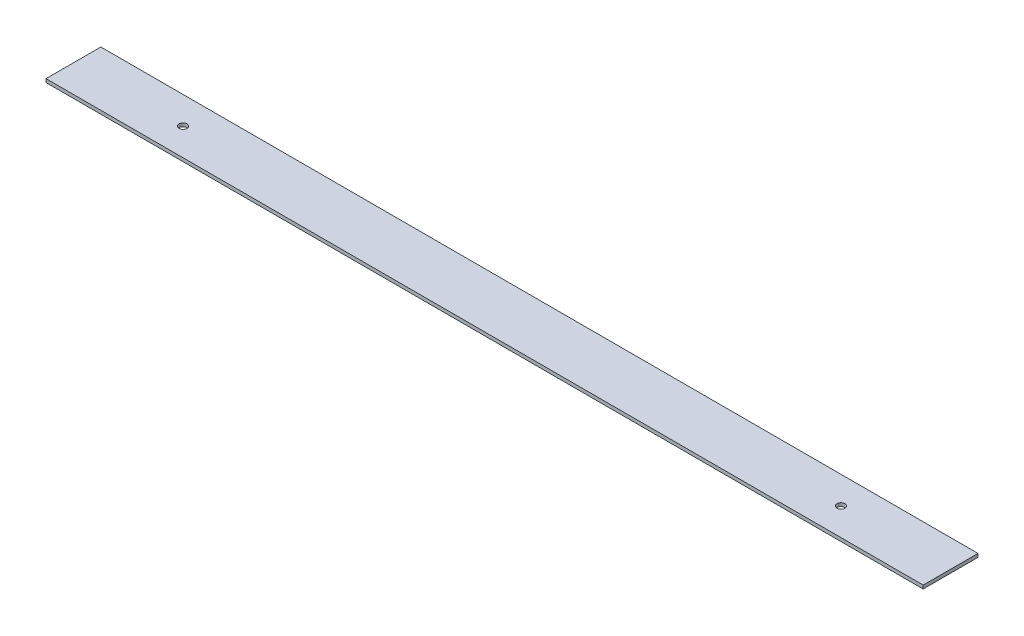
ISO-10303-21;
HEADER;
FILE_DESCRIPTION(('STEP AP214'),'2;1');
FILE_NAME('part.step','',(''),(''),'','','');
FILE_SCHEMA(('AUTOMOTIVE_DESIGN { 1 0 10303 214 1 1 1 1 }'));
ENDSEC;
DATA;
#1=APPLICATION_CONTEXT('core data for automotive mechanical design processes');
#2=APPLICATION_PROTOCOL_DEFINITION('international standard','automotive_design',2000,#1);
#3=PRODUCT_CONTEXT('',#1,'mechanical');
#4=PRODUCT('Part','Part','',(#3));
#5=PRODUCT_RELATED_PRODUCT_CATEGORY('part','',(#4));
#6=PRODUCT_DEFINITION_FORMATION('','',#4);
#7=PRODUCT_DEFINITION_CONTEXT('part definition',#1,'design');
#8=PRODUCT_DEFINITION('design','',#6,#7);
#9=PRODUCT_DEFINITION_SHAPE('','',#8);
#10=(LENGTH_UNIT() NAMED_UNIT(*) SI_UNIT(.MILLI.,.METRE.));
#11=(NAMED_UNIT(*) PLANE_ANGLE_UNIT() SI_UNIT($,.RADIAN.));
#12=(NAMED_UNIT(*) SI_UNIT($,.STERADIAN.) SOLID_ANGLE_UNIT());
#13=UNCERTAINTY_MEASURE_WITH_UNIT(LENGTH_MEASURE(1.E-05),#10,'distance_accuracy_value','');
#14=(GEOMETRIC_REPRESENTATION_CONTEXT(3) GLOBAL_UNCERTAINTY_ASSIGNED_CONTEXT((#13)) GLOBAL_UNIT_ASSIGNED_CONTEXT((#10,
#11,#12)) REPRESENTATION_CONTEXT('',''));
#15=CARTESIAN_POINT('',(0.,0.,0.));
#16=DIRECTION('',(0.,0.,1.));
#17=DIRECTION('',(1.,0.,0.));
#18=AXIS2_PLACEMENT_3D('',#15,#16,#17);
#19=CARTESIAN_POINT('',(609.6,4.7625,-38.1));
#20=DIRECTION('',(-1.,0.,0.));
#21=DIRECTION('',(0.,0.,1.));
#22=AXIS2_PLACEMENT_3D('',#19,#20,#21);
#23=PLANE('',#22);
#24=DIRECTION('',(0.,0.,-1.));
#25=VECTOR('',#24,1.);
#26=CARTESIAN_POINT('',(609.6,0.,-38.1));
#27=LINE('',#26,#25);
#28=CARTESIAN_POINT('',(609.6,0.,38.1));
#29=VERTEX_POINT('',#28);
#30=CARTESIAN_POINT('',(609.6,0.,-38.1));
#31=VERTEX_POINT('',#30);
#32=EDGE_CURVE('E96',#29,#31,#27,.T.);
#33=ORIENTED_EDGE('',*,*,#32,.T.);
#34=DIRECTION('',(0.,-1.,0.));
#35=VECTOR('',#34,1.);
#36=CARTESIAN_POINT('',(609.6,4.7625,-38.1));
#37=LINE('',#36,#35);
#38=CARTESIAN_POINT('',(609.6,4.7625,-38.1));
#39=VERTEX_POINT('',#38);
#40=EDGE_CURVE('E11',#39,#31,#37,.T.);
#41=ORIENTED_EDGE('',*,*,#40,.F.);
#42=DIRECTION('',(0.,0.,-1.));
#43=VECTOR('',#42,1.);
#44=CARTESIAN_POINT('',(609.6,4.7625,-38.1));
#45=LINE('',#44,#43);
#46=CARTESIAN_POINT('',(609.6,4.7625,38.1));
#47=VERTEX_POINT('',#46);
#48=EDGE_CURVE('E84',#47,#39,#45,.T.);
#49=ORIENTED_EDGE('',*,*,#48,.F.);
#50=DIRECTION('',(0.,-1.,0.));
#51=VECTOR('',#50,1.);
#52=CARTESIAN_POINT('',(609.6,4.7625,38.1));
#53=LINE('',#52,#51);
#54=EDGE_CURVE('E92',#47,#29,#53,.T.);
#55=ORIENTED_EDGE('',*,*,#54,.T.);
#56=EDGE_LOOP('',(#33,#41,#49,#55));
#57=FACE_BOUND('',#56,.T.);
#58=ADVANCED_FACE('F33',(#57),#23,.F.);
#59=CARTESIAN_POINT('',(-609.6,4.7625,-38.1));
#60=DIRECTION('',(0.,0.,1.));
#61=DIRECTION('',(1.,0.,0.));
#62=AXIS2_PLACEMENT_3D('',#59,#60,#61);
#63=PLANE('',#62);
#64=DIRECTION('',(-1.,0.,0.));
#65=VECTOR('',#64,1.);
#66=CARTESIAN_POINT('',(-609.6,0.,-38.1));
#67=LINE('',#66,#65);
#68=CARTESIAN_POINT('',(-609.6,0.,-38.1));
#69=VERTEX_POINT('',#68);
#70=EDGE_CURVE('E88',#31,#69,#67,.T.);
#71=ORIENTED_EDGE('',*,*,#70,.T.);
#72=DIRECTION('',(0.,-1.,0.));
#73=VECTOR('',#72,1.);
#74=CARTESIAN_POINT('',(-609.6,4.7625,-38.1));
#75=LINE('',#74,#73);
#76=CARTESIAN_POINT('',(-609.6,4.7625,-38.1));
#77=VERTEX_POINT('',#76);
#78=EDGE_CURVE('E41',#77,#69,#75,.T.);
#79=ORIENTED_EDGE('',*,*,#78,.F.);
#80=DIRECTION('',(-1.,0.,0.));
#81=VECTOR('',#80,1.);
#82=CARTESIAN_POINT('',(-609.6,4.7625,-38.1));
#83=LINE('',#82,#81);
#84=EDGE_CURVE('E79',#39,#77,#83,.T.);
#85=ORIENTED_EDGE('',*,*,#84,.F.);
#86=ORIENTED_EDGE('',*,*,#40,.T.);
#87=EDGE_LOOP('',(#71,#79,#85,#86));
#88=FACE_BOUND('',#87,.T.);
#89=ADVANCED_FACE('F87',(#88),#63,.F.);
#90=CARTESIAN_POINT('',(-609.6,4.7625,-38.1));
#91=DIRECTION('',(1.,0.,0.));
#92=DIRECTION('',(0.,0.,-1.));
#93=AXIS2_PLACEMENT_3D('',#90,#91,#92);
#94=PLANE('',#93);
#95=DIRECTION('',(0.,0.,1.));
#96=VECTOR('',#95,1.);
#97=CARTESIAN_POINT('',(-609.6,0.,-38.1));
#98=LINE('',#97,#96);
#99=CARTESIAN_POINT('',(-609.6,0.,38.1));
#100=VERTEX_POINT('',#99);
#101=EDGE_CURVE('E66',#69,#100,#98,.T.);
#102=ORIENTED_EDGE('',*,*,#101,.T.);
#103=DIRECTION('',(0.,-1.,0.));
#104=VECTOR('',#103,1.);
#105=CARTESIAN_POINT('',(-609.6,4.7625,38.1));
#106=LINE('',#105,#104);
#107=CARTESIAN_POINT('',(-609.6,4.7625,38.1));
#108=VERTEX_POINT('',#107);
#109=EDGE_CURVE('E89',#108,#100,#106,.T.);
#110=ORIENTED_EDGE('',*,*,#109,.F.);
#111=DIRECTION('',(0.,0.,1.));
#112=VECTOR('',#111,1.);
#113=CARTESIAN_POINT('',(-609.6,4.7625,-38.1));
#114=LINE('',#113,#112);
#115=EDGE_CURVE('E82',#77,#108,#114,.T.);
#116=ORIENTED_EDGE('',*,*,#115,.F.);
#117=ORIENTED_EDGE('',*,*,#78,.T.);
#118=EDGE_LOOP('',(#102,#110,#116,#117));
#119=FACE_BOUND('',#118,.T.);
#120=ADVANCED_FACE('F90',(#119),#94,.F.);
#121=CARTESIAN_POINT('',(-609.6,4.7625,38.1));
#122=DIRECTION('',(0.,0.,-1.));
#123=DIRECTION('',(-1.,0.,0.));
#124=AXIS2_PLACEMENT_3D('',#121,#122,#123);
#125=PLANE('',#124);
#126=DIRECTION('',(1.,0.,0.));
#127=VECTOR('',#126,1.);
#128=CARTESIAN_POINT('',(-609.6,0.,38.1));
#129=LINE('',#128,#127);
#130=EDGE_CURVE('E72',#100,#29,#129,.T.);
#131=ORIENTED_EDGE('',*,*,#130,.T.);
#132=ORIENTED_EDGE('',*,*,#54,.F.);
#133=DIRECTION('',(1.,0.,0.));
#134=VECTOR('',#133,1.);
#135=CARTESIAN_POINT('',(-609.6,4.7625,38.1));
#136=LINE('',#135,#134);
#137=EDGE_CURVE('E49',#108,#47,#136,.T.);
#138=ORIENTED_EDGE('',*,*,#137,.F.);
#139=ORIENTED_EDGE('',*,*,#109,.T.);
#140=EDGE_LOOP('',(#131,#132,#138,#139));
#141=FACE_BOUND('',#140,.T.);
#142=ADVANCED_FACE('F104',(#141),#125,.F.);
#143=CARTESIAN_POINT('',(0.,4.7625,0.));
#144=DIRECTION('',(0.,1.,0.));
#145=DIRECTION('',(0.,0.,1.));
#146=AXIS2_PLACEMENT_3D('',#143,#144,#145);
#147=PLANE('',#146);
#148=CARTESIAN_POINT('',(-457.2,4.7625,0.));
#149=DIRECTION('',(0.,1.,0.));
#150=DIRECTION('',(0.,0.,1.));
#151=AXIS2_PLACEMENT_3D('',#148,#149,#150);
#152=CIRCLE('',#151,5.55624999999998);
#153=CARTESIAN_POINT('',(-457.2,4.7625,5.55624999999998));
#154=VERTEX_POINT('',#153);
#155=EDGE_CURVE('E118',#154,#154,#152,.T.);
#156=ORIENTED_EDGE('',*,*,#155,.F.);
#157=EDGE_LOOP('',(#156));
#158=FACE_BOUND('',#157,.T.);
#159=CARTESIAN_POINT('',(457.2,4.7625,0.));
#160=DIRECTION('',(0.,1.,0.));
#161=DIRECTION('',(0.,0.,1.));
#162=AXIS2_PLACEMENT_3D('',#159,#160,#161);
#163=CIRCLE('',#162,5.55624999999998);
#164=CARTESIAN_POINT('',(457.2,4.7625,5.55624999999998));
#165=VERTEX_POINT('',#164);
#166=EDGE_CURVE('E112',#165,#165,#163,.T.);
#167=ORIENTED_EDGE('',*,*,#166,.F.);
#168=EDGE_LOOP('',(#167));
#169=FACE_BOUND('',#168,.T.);
#170=ORIENTED_EDGE('',*,*,#48,.T.);
#171=ORIENTED_EDGE('',*,*,#84,.T.);
#172=ORIENTED_EDGE('',*,*,#115,.T.);
#173=ORIENTED_EDGE('',*,*,#137,.T.);
#174=EDGE_LOOP('',(#170,#171,#172,#173));
#175=FACE_BOUND('',#174,.T.);
#176=ADVANCED_FACE('F80',(#158,#169,#175),#147,.T.);
#177=CARTESIAN_POINT('',(0.,0.,0.));
#178=DIRECTION('',(0.,1.,0.));
#179=DIRECTION('',(0.,0.,1.));
#180=AXIS2_PLACEMENT_3D('',#177,#178,#179);
#181=PLANE('',#180);
#182=CARTESIAN_POINT('',(-457.2,0.,0.));
#183=DIRECTION('',(0.,1.,0.));
#184=DIRECTION('',(0.,0.,1.));
#185=AXIS2_PLACEMENT_3D('',#182,#183,#184);
#186=CIRCLE('',#185,5.55624999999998);
#187=CARTESIAN_POINT('',(-457.2,0.,5.55624999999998));
#188=VERTEX_POINT('',#187);
#189=EDGE_CURVE('E115',#188,#188,#186,.T.);
#190=ORIENTED_EDGE('',*,*,#189,.T.);
#191=EDGE_LOOP('',(#190));
#192=FACE_BOUND('',#191,.T.);
#193=CARTESIAN_POINT('',(457.2,0.,0.));
#194=DIRECTION('',(0.,1.,0.));
#195=DIRECTION('',(0.,0.,1.));
#196=AXIS2_PLACEMENT_3D('',#193,#194,#195);
#197=CIRCLE('',#196,5.55624999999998);
#198=CARTESIAN_POINT('',(457.2,0.,5.55624999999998));
#199=VERTEX_POINT('',#198);
#200=EDGE_CURVE('E99',#199,#199,#197,.T.);
#201=ORIENTED_EDGE('',*,*,#200,.T.);
#202=EDGE_LOOP('',(#201));
#203=FACE_BOUND('',#202,.T.);
#204=ORIENTED_EDGE('',*,*,#32,.F.);
#205=ORIENTED_EDGE('',*,*,#130,.F.);
#206=ORIENTED_EDGE('',*,*,#101,.F.);
#207=ORIENTED_EDGE('',*,*,#70,.F.);
#208=EDGE_LOOP('',(#204,#205,#206,#207));
#209=FACE_BOUND('',#208,.T.);
#210=ADVANCED_FACE('F107',(#192,#203,#209),#181,.F.);
#211=CARTESIAN_POINT('',(457.2,4.7625,0.));
#212=DIRECTION('',(0.,1.,0.));
#213=DIRECTION('',(0.,0.,1.));
#214=AXIS2_PLACEMENT_3D('',#211,#212,#213);
#215=CYLINDRICAL_SURFACE('',#214,5.55624999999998);
#216=ORIENTED_EDGE('',*,*,#200,.F.);
#217=EDGE_LOOP('',(#216));
#218=FACE_BOUND('',#217,.T.);
#219=ORIENTED_EDGE('',*,*,#166,.T.);
#220=EDGE_LOOP('',(#219));
#221=FACE_BOUND('',#220,.T.);
#222=ADVANCED_FACE('F129',(#218,#221),#215,.F.);
#223=CARTESIAN_POINT('',(-457.2,4.7625,0.));
#224=DIRECTION('',(0.,1.,0.));
#225=DIRECTION('',(0.,0.,1.));
#226=AXIS2_PLACEMENT_3D('',#223,#224,#225);
#227=CYLINDRICAL_SURFACE('',#226,5.55624999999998);
#228=ORIENTED_EDGE('',*,*,#189,.F.);
#229=EDGE_LOOP('',(#228));
#230=FACE_BOUND('',#229,.T.);
#231=ORIENTED_EDGE('',*,*,#155,.T.);
#232=EDGE_LOOP('',(#231));
#233=FACE_BOUND('',#232,.T.);
#234=ADVANCED_FACE('F122',(#230,#233),#227,.F.);
#235=CLOSED_SHELL('',(#58,#89,#120,#142,#176,#210,#222,#234));
#236=MANIFOLD_SOLID_BREP('B2',#235);
#237=ADVANCED_BREP_SHAPE_REPRESENTATION('',(#18,#236),#14);
#238=SHAPE_DEFINITION_REPRESENTATION(#9,#237);
ENDSEC;
END-ISO-10303-21;
